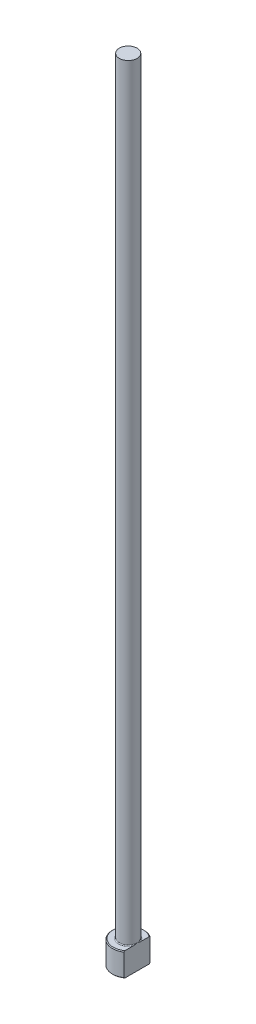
ISO-10303-21;
HEADER;
FILE_DESCRIPTION(('STEP AP214'),'2;1');
FILE_NAME('part.step','',(''),(''),'','','');
FILE_SCHEMA(('AUTOMOTIVE_DESIGN { 1 0 10303 214 1 1 1 1 }'));
ENDSEC;
DATA;
#1=APPLICATION_CONTEXT('core data for automotive mechanical design processes');
#2=APPLICATION_PROTOCOL_DEFINITION('international standard','automotive_design',2000,#1);
#3=PRODUCT_CONTEXT('',#1,'mechanical');
#4=PRODUCT('Part','Part','',(#3));
#5=PRODUCT_RELATED_PRODUCT_CATEGORY('part','',(#4));
#6=PRODUCT_DEFINITION_FORMATION('','',#4);
#7=PRODUCT_DEFINITION_CONTEXT('part definition',#1,'design');
#8=PRODUCT_DEFINITION('design','',#6,#7);
#9=PRODUCT_DEFINITION_SHAPE('','',#8);
#10=(LENGTH_UNIT() NAMED_UNIT(*) SI_UNIT(.MILLI.,.METRE.));
#11=(NAMED_UNIT(*) PLANE_ANGLE_UNIT() SI_UNIT($,.RADIAN.));
#12=(NAMED_UNIT(*) SI_UNIT($,.STERADIAN.) SOLID_ANGLE_UNIT());
#13=UNCERTAINTY_MEASURE_WITH_UNIT(LENGTH_MEASURE(1.E-05),#10,'distance_accuracy_value','');
#14=(GEOMETRIC_REPRESENTATION_CONTEXT(3) GLOBAL_UNCERTAINTY_ASSIGNED_CONTEXT((#13)) GLOBAL_UNIT_ASSIGNED_CONTEXT((#10,
#11,#12)) REPRESENTATION_CONTEXT('',''));
#15=CARTESIAN_POINT('',(0.,0.,0.));
#16=DIRECTION('',(0.,0.,1.));
#17=DIRECTION('',(1.,0.,0.));
#18=AXIS2_PLACEMENT_3D('',#15,#16,#17);
#19=CARTESIAN_POINT('',(0.,0.,0.));
#20=DIRECTION('',(0.,-1.,0.));
#21=DIRECTION('',(0.,0.,-1.));
#22=AXIS2_PLACEMENT_3D('',#19,#20,#21);
#23=PLANE('',#22);
#24=CARTESIAN_POINT('',(0.,0.,0.));
#25=DIRECTION('',(0.,-1.,0.));
#26=DIRECTION('',(0.,0.,-1.));
#27=AXIS2_PLACEMENT_3D('',#24,#25,#26);
#28=CIRCLE('',#27,3.79999999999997);
#29=CARTESIAN_POINT('',(2.24999999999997,0.,3.0622703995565));
#30=VERTEX_POINT('',#29);
#31=CARTESIAN_POINT('',(2.24999999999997,0.,-3.0622703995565));
#32=VERTEX_POINT('',#31);
#33=EDGE_CURVE('E98',#30,#32,#28,.T.);
#34=ORIENTED_EDGE('',*,*,#33,.T.);
#35=DIRECTION('',(0.,0.,1.));
#36=VECTOR('',#35,1.);
#37=CARTESIAN_POINT('',(2.24999999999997,0.,3.30718913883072));
#38=LINE('',#37,#36);
#39=EDGE_CURVE('E83',#32,#30,#38,.T.);
#40=ORIENTED_EDGE('',*,*,#39,.T.);
#41=EDGE_LOOP('',(#34,#40));
#42=FACE_BOUND('',#41,.T.);
#43=ADVANCED_FACE('F32',(#42),#23,.T.);
#44=CARTESIAN_POINT('',(0.,259.958771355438,0.));
#45=DIRECTION('',(0.,1.,0.));
#46=DIRECTION('',(0.,0.,1.));
#47=AXIS2_PLACEMENT_3D('',#44,#45,#46);
#48=CYLINDRICAL_SURFACE('',#47,3.99999999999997);
#49=CARTESIAN_POINT('',(0.,5.80000000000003,0.));
#50=DIRECTION('',(0.,1.,0.));
#51=DIRECTION('',(0.,0.,1.));
#52=AXIS2_PLACEMENT_3D('',#49,#50,#51);
#53=CIRCLE('',#52,3.99999999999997);
#54=CARTESIAN_POINT('',(2.24999999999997,5.80000000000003,3.30718913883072));
#55=VERTEX_POINT('',#54);
#56=CARTESIAN_POINT('',(2.24999999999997,5.80000000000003,-3.30718913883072));
#57=VERTEX_POINT('',#56);
#58=EDGE_CURVE('E104',#55,#57,#53,.F.);
#59=ORIENTED_EDGE('',*,*,#58,.T.);
#60=DIRECTION('',(0.,-1.,0.));
#61=VECTOR('',#60,1.);
#62=CARTESIAN_POINT('',(2.24999999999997,200.,-3.30718913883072));
#63=LINE('',#62,#61);
#64=CARTESIAN_POINT('',(2.24999999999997,0.199999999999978,-3.30718913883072));
#65=VERTEX_POINT('',#64);
#66=EDGE_CURVE('E183',#57,#65,#63,.T.);
#67=ORIENTED_EDGE('',*,*,#66,.T.);
#68=CARTESIAN_POINT('',(0.,0.199999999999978,0.));
#69=DIRECTION('',(0.,-1.,0.));
#70=DIRECTION('',(0.,0.,-1.));
#71=AXIS2_PLACEMENT_3D('',#68,#69,#70);
#72=CIRCLE('',#71,3.99999999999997);
#73=CARTESIAN_POINT('',(2.24999999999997,0.199999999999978,3.30718913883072));
#74=VERTEX_POINT('',#73);
#75=EDGE_CURVE('E100',#65,#74,#72,.F.);
#76=ORIENTED_EDGE('',*,*,#75,.T.);
#77=DIRECTION('',(0.,-1.,0.));
#78=VECTOR('',#77,1.);
#79=CARTESIAN_POINT('',(2.24999999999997,200.,3.30718913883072));
#80=LINE('',#79,#78);
#81=EDGE_CURVE('E93',#55,#74,#80,.T.);
#82=ORIENTED_EDGE('',*,*,#81,.F.);
#83=EDGE_LOOP('',(#59,#67,#76,#82));
#84=FACE_BOUND('',#83,.T.);
#85=ADVANCED_FACE('F158',(#84),#48,.T.);
#86=CARTESIAN_POINT('',(-3.99999999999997,6.,0.));
#87=DIRECTION('',(0.,1.,0.));
#88=DIRECTION('',(0.,0.,1.));
#89=AXIS2_PLACEMENT_3D('',#86,#87,#88);
#90=PLANE('',#89);
#91=CARTESIAN_POINT('',(0.,6.,0.));
#92=DIRECTION('',(0.,1.,0.));
#93=DIRECTION('',(0.,0.,1.));
#94=AXIS2_PLACEMENT_3D('',#91,#92,#93);
#95=CIRCLE('',#94,3.80000000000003);
#96=CARTESIAN_POINT('',(2.24999999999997,6.,-3.06227039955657));
#97=VERTEX_POINT('',#96);
#98=CARTESIAN_POINT('',(2.24999999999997,6.,3.06227039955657));
#99=VERTEX_POINT('',#98);
#100=EDGE_CURVE('E178',#97,#99,#95,.T.);
#101=ORIENTED_EDGE('',*,*,#100,.T.);
#102=DIRECTION('',(0.,0.,-1.));
#103=VECTOR('',#102,1.);
#104=CARTESIAN_POINT('',(2.24999999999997,6.,0.));
#105=LINE('',#104,#103);
#106=CARTESIAN_POINT('',(2.24999999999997,5.99999999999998,0.969535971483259));
#107=VERTEX_POINT('',#106);
#108=EDGE_CURVE('E57',#99,#107,#105,.T.);
#109=ORIENTED_EDGE('',*,*,#108,.T.);
#110=CARTESIAN_POINT('',(0.,6.,0.));
#111=DIRECTION('',(0.,1.,0.));
#112=DIRECTION('',(0.,0.,1.));
#113=AXIS2_PLACEMENT_3D('',#110,#111,#112);
#114=CIRCLE('',#113,2.44999999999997);
#115=CARTESIAN_POINT('',(2.24999999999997,5.99999999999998,-0.969535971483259));
#116=VERTEX_POINT('',#115);
#117=EDGE_CURVE('E107',#107,#116,#114,.F.);
#118=ORIENTED_EDGE('',*,*,#117,.T.);
#119=EDGE_CURVE('E136',#116,#97,#105,.T.);
#120=ORIENTED_EDGE('',*,*,#119,.T.);
#121=EDGE_LOOP('',(#101,#109,#118,#120));
#122=FACE_BOUND('',#121,.T.);
#123=ADVANCED_FACE('F147',(#122),#90,.T.);
#124=CARTESIAN_POINT('',(0.,6.00000000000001,0.));
#125=DIRECTION('',(0.,-1.,0.));
#126=DIRECTION('',(0.,0.,-1.));
#127=AXIS2_PLACEMENT_3D('',#124,#125,#126);
#128=CONICAL_SURFACE('',#127,3.80000000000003,0.785398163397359);
#129=ORIENTED_EDGE('',*,*,#58,.F.);
#130=CARTESIAN_POINT('',(2.24999999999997,2.1823029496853,7.27782992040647));
#131=CARTESIAN_POINT('',(2.24999999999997,2.30866715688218,7.14556140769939));
#132=CARTESIAN_POINT('',(2.24999999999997,2.4348777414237,7.01314597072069));
#133=CARTESIAN_POINT('',(2.24999999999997,2.68692885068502,6.74796170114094));
#134=CARTESIAN_POINT('',(2.24999999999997,2.81276937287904,6.61519286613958));
#135=CARTESIAN_POINT('',(2.24999999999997,3.18970572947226,6.21619905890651));
#136=CARTESIAN_POINT('',(2.24999999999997,3.44014920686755,5.94935693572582));
#137=CARTESIAN_POINT('',(2.24999999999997,3.94026066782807,5.41146981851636));
#138=CARTESIAN_POINT('',(2.24999999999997,4.18991116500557,5.14040850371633));
#139=CARTESIAN_POINT('',(2.24999999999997,4.56140055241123,4.73113683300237));
#140=CARTESIAN_POINT('',(2.24999999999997,4.68472451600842,4.59427552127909));
#141=CARTESIAN_POINT('',(2.24999999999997,4.93009407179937,4.31941326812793));
#142=CARTESIAN_POINT('',(2.24999999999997,5.05213967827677,4.18141233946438));
#143=CARTESIAN_POINT('',(2.24999999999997,5.31419582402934,3.88150807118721));
#144=CARTESIAN_POINT('',(2.24999999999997,5.4539170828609,3.71935099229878));
#145=CARTESIAN_POINT('',(2.24999999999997,5.73025215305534,3.39234412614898));
#146=CARTESIAN_POINT('',(2.24999999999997,5.86686529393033,3.22749377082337));
#147=CARTESIAN_POINT('',(2.24999999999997,6.13534139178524,2.89430849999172));
#148=CARTESIAN_POINT('',(2.24999999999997,6.26721073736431,2.72597879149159));
#149=CARTESIAN_POINT('',(2.24999999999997,6.45966785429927,2.46950762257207));
#150=CARTESIAN_POINT('',(2.24999999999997,6.52291962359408,2.38336821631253));
#151=CARTESIAN_POINT('',(2.24999999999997,6.64714184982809,2.20946418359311));
#152=CARTESIAN_POINT('',(2.24999999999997,6.7081125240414,2.12169971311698));
#153=CARTESIAN_POINT('',(2.24999999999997,6.82102230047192,1.95327886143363));
#154=CARTESIAN_POINT('',(2.24999999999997,6.87324695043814,1.87281476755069));
#155=CARTESIAN_POINT('',(2.24999999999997,6.97467249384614,1.70998172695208));
#156=CARTESIAN_POINT('',(2.24999999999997,7.02387305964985,1.62761257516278));
#157=CARTESIAN_POINT('',(2.24999999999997,7.11837607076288,1.46059799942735));
#158=CARTESIAN_POINT('',(2.24999999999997,7.16367708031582,1.37595175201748));
#159=CARTESIAN_POINT('',(2.24999999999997,7.24914050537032,1.20413766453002));
#160=CARTESIAN_POINT('',(2.24999999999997,7.28930406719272,1.11697039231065));
#161=CARTESIAN_POINT('',(2.24999999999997,7.38314726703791,0.891175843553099));
#162=CARTESIAN_POINT('',(2.24999999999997,7.43219749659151,0.750488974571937));
#163=CARTESIAN_POINT('',(2.24999999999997,7.48826674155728,0.53515963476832));
#164=CARTESIAN_POINT('',(2.24999999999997,7.5040284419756,0.462776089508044));
#165=CARTESIAN_POINT('',(2.24999999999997,7.52893388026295,0.316860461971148));
#166=CARTESIAN_POINT('',(2.24999999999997,7.53807847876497,0.24332853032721));
#167=CARTESIAN_POINT('',(2.24999999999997,7.54922474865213,0.0949504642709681));
#168=CARTESIAN_POINT('',(2.24999999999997,7.55115152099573,0.0200986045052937));
#169=CARTESIAN_POINT('',(2.24999999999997,7.54752076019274,-0.129420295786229));
#170=CARTESIAN_POINT('',(2.24999999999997,7.54196316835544,-0.204087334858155));
#171=CARTESIAN_POINT('',(2.24999999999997,7.52372329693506,-0.352688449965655));
#172=CARTESIAN_POINT('',(2.24999999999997,7.51102617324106,-0.426620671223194));
#173=CARTESIAN_POINT('',(2.24999999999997,7.47926333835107,-0.573094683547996));
#174=CARTESIAN_POINT('',(2.24999999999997,7.46019612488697,-0.645636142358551));
#175=CARTESIAN_POINT('',(2.24999999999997,7.40610994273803,-0.82370101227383));
#176=CARTESIAN_POINT('',(2.24999999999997,7.36783449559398,-0.928230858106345));
#177=CARTESIAN_POINT('',(2.24999999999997,7.28232692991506,-1.13354070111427));
#178=CARTESIAN_POINT('',(2.24999999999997,7.23508812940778,-1.23431783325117));
#179=CARTESIAN_POINT('',(2.24999999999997,7.13380125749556,-1.43298762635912));
#180=CARTESIAN_POINT('',(2.24999999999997,7.07972026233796,-1.53086330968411));
#181=CARTESIAN_POINT('',(2.24999999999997,6.99496203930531,-1.67548648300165));
#182=CARTESIAN_POINT('',(2.24999999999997,6.96610811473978,-1.72332162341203));
#183=CARTESIAN_POINT('',(2.24999999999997,6.90734436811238,-1.81833709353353));
#184=CARTESIAN_POINT('',(2.24999999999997,6.8774345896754,-1.8655174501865));
#185=CARTESIAN_POINT('',(2.24999999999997,6.77509597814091,-2.02354622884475));
#186=CARTESIAN_POINT('',(2.24999999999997,6.70057106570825,-2.13303820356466));
#187=CARTESIAN_POINT('',(2.24999999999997,6.54784662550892,-2.34943854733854));
#188=CARTESIAN_POINT('',(2.24999999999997,6.4696462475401,-2.45634630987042));
#189=CARTESIAN_POINT('',(2.24999999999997,6.31046802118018,-2.66818697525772));
#190=CARTESIAN_POINT('',(2.24999999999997,6.22948822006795,-2.77311840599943));
#191=CARTESIAN_POINT('',(2.24999999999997,6.06545223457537,-2.98134898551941));
#192=CARTESIAN_POINT('',(2.24999999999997,5.98239592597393,-3.08464803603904));
#193=CARTESIAN_POINT('',(2.24999999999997,5.73044258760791,-3.39308007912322));
#194=CARTESIAN_POINT('',(2.24999999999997,5.55914389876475,-3.59624854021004));
#195=CARTESIAN_POINT('',(2.24999999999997,5.21260420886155,-3.99901521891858));
#196=CARTESIAN_POINT('',(2.24999999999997,5.03736490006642,-4.19861490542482));
#197=CARTESIAN_POINT('',(2.24999999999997,4.68403823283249,-4.59551245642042));
#198=CARTESIAN_POINT('',(2.24999999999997,4.50594904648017,-4.79280869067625));
#199=CARTESIAN_POINT('',(2.24999999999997,4.14782580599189,-5.18566037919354));
#200=CARTESIAN_POINT('',(2.24999999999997,3.96779155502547,-5.38121565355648));
#201=CARTESIAN_POINT('',(2.24999999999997,3.60651922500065,-5.77078870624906));
#202=CARTESIAN_POINT('',(2.24999999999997,3.42528278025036,-5.96480800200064));
#203=CARTESIAN_POINT('',(2.24999999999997,3.06174631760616,-6.35184762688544));
#204=CARTESIAN_POINT('',(2.24999999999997,2.87944629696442,-6.54486795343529));
#205=CARTESIAN_POINT('',(2.24999999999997,2.6111232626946,-6.82775668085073));
#206=CARTESIAN_POINT('',(2.24999999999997,2.52542128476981,-6.91792994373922));
#207=CARTESIAN_POINT('',(2.24999999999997,2.35393773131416,-7.09803491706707));
#208=CARTESIAN_POINT('',(2.24999999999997,2.26815631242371,-7.1879667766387));
#209=CARTESIAN_POINT('',(2.24999999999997,2.1823029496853,-7.27782992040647));
#210=B_SPLINE_CURVE_WITH_KNOTS('',3,(#130,#131,#132,#133,#134,#135,#136,#137,#138,#139,#140,
#141,#142,#143,#144,#145,#146,#147,#148,#149,#150,#151,#152,#153,#154,#155,#156,#157,#158,#159,
#160,#161,#162,#163,#164,#165,#166,#167,#168,#169,#170,#171,#172,#173,#174,#175,#176,#177,#178,
#179,#180,#181,#182,#183,#184,#185,#186,#187,#188,#189,#190,#191,#192,#193,#194,#195,#196,#197,
#198,#199,#200,#201,#202,#203,#204,#205,#206,#207,#208,#209),.UNSPECIFIED.,.F.,.F.,(4,2,2,2,2,2,
2,2,2,2,2,2,2,2,2,2,2,2,2,2,2,2,2,2,2,2,2,2,2,2,2,2,2,2,2,2,2,2,2,4),(0.,0.548785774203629,
1.09757528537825,2.19544562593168,3.30094607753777,3.85362276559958,4.40629327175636,
5.04841012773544,5.69066421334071,6.33201824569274,6.65259523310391,6.97314160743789,
7.26086761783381,7.54862474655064,7.83648737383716,8.12428565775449,8.56956070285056,
8.7915473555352,9.01350513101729,9.23775987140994,9.46201637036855,9.68674086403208,
9.91151839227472,10.2448678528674,10.5784668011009,10.9137368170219,11.0813178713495,
11.2488920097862,11.6461164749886,12.0434332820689,12.4410351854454,12.838660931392,
13.63579912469,14.4326012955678,15.2299368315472,16.0273538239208,16.8238479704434,
17.6203441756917,17.9935523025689,18.3664002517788),.UNSPECIFIED.);
#211=EDGE_CURVE('E135',#55,#99,#210,.T.);
#212=ORIENTED_EDGE('',*,*,#211,.T.);
#213=ORIENTED_EDGE('',*,*,#100,.F.);
#214=EDGE_CURVE('E127',#97,#57,#210,.T.);
#215=ORIENTED_EDGE('',*,*,#214,.T.);
#216=EDGE_LOOP('',(#129,#212,#213,#215));
#217=FACE_BOUND('',#216,.T.);
#218=ADVANCED_FACE('F143',(#217),#128,.T.);
#219=CARTESIAN_POINT('',(0.,0.199999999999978,0.));
#220=DIRECTION('',(0.,1.,0.));
#221=DIRECTION('',(0.,0.,1.));
#222=AXIS2_PLACEMENT_3D('',#219,#220,#221);
#223=CONICAL_SURFACE('',#222,3.99999999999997,0.785398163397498);
#224=ORIENTED_EDGE('',*,*,#75,.F.);
#225=CARTESIAN_POINT('',(2.24999999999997,3.81769705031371,-7.27782992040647));
#226=CARTESIAN_POINT('',(2.24999999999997,3.69133284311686,-7.14556140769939));
#227=CARTESIAN_POINT('',(2.24999999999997,3.56512225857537,-7.01314597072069));
#228=CARTESIAN_POINT('',(2.24999999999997,3.31307114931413,-6.74796170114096));
#229=CARTESIAN_POINT('',(2.24999999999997,3.18723062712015,-6.6151928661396));
#230=CARTESIAN_POINT('',(2.24999999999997,2.81029427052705,-6.21619905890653));
#231=CARTESIAN_POINT('',(2.24999999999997,2.55985079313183,-5.94935693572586));
#232=CARTESIAN_POINT('',(2.24999999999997,2.05973933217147,-5.4114698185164));
#233=CARTESIAN_POINT('',(2.24999999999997,1.81008883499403,-5.14040850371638));
#234=CARTESIAN_POINT('',(2.24999999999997,1.43859944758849,-4.73113683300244));
#235=CARTESIAN_POINT('',(2.24999999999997,1.31527548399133,-4.59427552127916));
#236=CARTESIAN_POINT('',(2.24999999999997,1.06990592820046,-4.319413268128));
#237=CARTESIAN_POINT('',(2.24999999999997,0.947860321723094,-4.18141233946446));
#238=CARTESIAN_POINT('',(2.24999999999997,0.685804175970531,-3.88150807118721));
#239=CARTESIAN_POINT('',(2.24999999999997,0.546082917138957,-3.71935099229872));
#240=CARTESIAN_POINT('',(2.24999999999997,0.269747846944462,-3.39234412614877));
#241=CARTESIAN_POINT('',(2.24999999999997,0.133134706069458,-3.22749377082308));
#242=CARTESIAN_POINT('',(2.24999999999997,-0.135341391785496,-2.89430849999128));
#243=CARTESIAN_POINT('',(2.24999999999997,-0.267210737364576,-2.72597879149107));
#244=CARTESIAN_POINT('',(2.24999999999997,-0.459667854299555,-2.46950762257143));
#245=CARTESIAN_POINT('',(2.24999999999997,-0.522919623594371,-2.38336821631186));
#246=CARTESIAN_POINT('',(2.24999999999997,-0.64714184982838,-2.20946418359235));
#247=CARTESIAN_POINT('',(2.24999999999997,-0.708112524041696,-2.12169971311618));
#248=CARTESIAN_POINT('',(2.24999999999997,-0.821022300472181,-1.9532788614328));
#249=CARTESIAN_POINT('',(2.24999999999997,-0.87324695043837,-1.87281476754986));
#250=CARTESIAN_POINT('',(2.24999999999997,-0.974672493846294,-1.70998172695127));
#251=CARTESIAN_POINT('',(2.24999999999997,-1.02387305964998,-1.62761257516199));
#252=CARTESIAN_POINT('',(2.24999999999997,-1.11837607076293,-1.46059799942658));
#253=CARTESIAN_POINT('',(2.24999999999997,-1.16367708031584,-1.37595175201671));
#254=CARTESIAN_POINT('',(2.24999999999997,-1.24914050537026,-1.20413766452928));
#255=CARTESIAN_POINT('',(2.24999999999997,-1.28930406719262,-1.11697039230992));
#256=CARTESIAN_POINT('',(2.24999999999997,-1.38314726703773,-0.891175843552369));
#257=CARTESIAN_POINT('',(2.24999999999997,-1.43219749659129,-0.750488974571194));
#258=CARTESIAN_POINT('',(2.24999999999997,-1.48826674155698,-0.535159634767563));
#259=CARTESIAN_POINT('',(2.24999999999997,-1.50402844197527,-0.462776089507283));
#260=CARTESIAN_POINT('',(2.24999999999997,-1.52893388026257,-0.316860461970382));
#261=CARTESIAN_POINT('',(2.24999999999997,-1.53807847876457,-0.243328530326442));
#262=CARTESIAN_POINT('',(2.24999999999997,-1.54922474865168,-0.0949504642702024));
#263=CARTESIAN_POINT('',(2.24999999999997,-1.55115152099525,-0.0200986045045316));
#264=CARTESIAN_POINT('',(2.24999999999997,-1.54752076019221,0.129420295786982));
#265=CARTESIAN_POINT('',(2.24999999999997,-1.54196316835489,0.204087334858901));
#266=CARTESIAN_POINT('',(2.24999999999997,-1.52372329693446,0.352688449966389));
#267=CARTESIAN_POINT('',(2.24999999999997,-1.51102617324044,0.42662067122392));
#268=CARTESIAN_POINT('',(2.24999999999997,-1.47926333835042,0.573094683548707));
#269=CARTESIAN_POINT('',(2.24999999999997,-1.46019612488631,0.645636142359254));
#270=CARTESIAN_POINT('',(2.24999999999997,-1.40610994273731,0.823701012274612));
#271=CARTESIAN_POINT('',(2.24999999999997,-1.36783449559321,0.92823085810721));
#272=CARTESIAN_POINT('',(2.24999999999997,-1.28232692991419,1.1335407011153));
#273=CARTESIAN_POINT('',(2.24999999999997,-1.23508812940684,1.23431783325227));
#274=CARTESIAN_POINT('',(2.24999999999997,-1.13380125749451,1.43298762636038));
#275=CARTESIAN_POINT('',(2.24999999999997,-1.07972026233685,1.53086330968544));
#276=CARTESIAN_POINT('',(2.24999999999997,-0.994962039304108,1.6754864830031));
#277=CARTESIAN_POINT('',(2.24999999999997,-0.966108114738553,1.72332162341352));
#278=CARTESIAN_POINT('',(2.24999999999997,-0.907344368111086,1.81833709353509));
#279=CARTESIAN_POINT('',(2.24999999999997,-0.877434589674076,1.8655174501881));
#280=CARTESIAN_POINT('',(2.24999999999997,-0.775095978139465,2.0235462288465));
#281=CARTESIAN_POINT('',(2.24999999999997,-0.700571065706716,2.13303820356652));
#282=CARTESIAN_POINT('',(2.24999999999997,-0.547846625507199,2.34943854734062));
#283=CARTESIAN_POINT('',(2.24999999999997,-0.469646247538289,2.45634630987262));
#284=CARTESIAN_POINT('',(2.24999999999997,-0.310468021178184,2.66818697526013));
#285=CARTESIAN_POINT('',(2.24999999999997,-0.229488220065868,2.77311840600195));
#286=CARTESIAN_POINT('',(2.24999999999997,-0.065452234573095,2.98134898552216));
#287=CARTESIAN_POINT('',(2.24999999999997,0.0176040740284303,3.0846480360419));
#288=CARTESIAN_POINT('',(2.24999999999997,0.269557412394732,3.39308007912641));
#289=CARTESIAN_POINT('',(2.24999999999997,0.440856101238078,3.59624854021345));
#290=CARTESIAN_POINT('',(2.24999999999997,0.787395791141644,3.99901521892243));
#291=CARTESIAN_POINT('',(2.24999999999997,0.962635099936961,4.19861490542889));
#292=CARTESIAN_POINT('',(2.24999999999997,1.31596176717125,4.59551245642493));
#293=CARTESIAN_POINT('',(2.24999999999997,1.49405095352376,4.79280869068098));
#294=CARTESIAN_POINT('',(2.24999999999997,1.8521741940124,5.18566037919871));
#295=CARTESIAN_POINT('',(2.24999999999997,2.03220844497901,5.38121565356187));
#296=CARTESIAN_POINT('',(2.24999999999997,2.39348077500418,5.7707887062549));
#297=CARTESIAN_POINT('',(2.24999999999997,2.57471721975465,5.9648080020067));
#298=CARTESIAN_POINT('',(2.24999999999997,2.93825368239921,6.35184762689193));
#299=CARTESIAN_POINT('',(2.24999999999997,3.12055370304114,6.54486795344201));
#300=CARTESIAN_POINT('',(2.24999999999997,3.38887673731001,6.82775668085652));
#301=CARTESIAN_POINT('',(2.24999999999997,3.47457871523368,6.91792994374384));
#302=CARTESIAN_POINT('',(2.24999999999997,3.64606226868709,7.09803491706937));
#303=CARTESIAN_POINT('',(2.24999999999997,3.73184368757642,7.18796677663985));
#304=CARTESIAN_POINT('',(2.24999999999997,3.81769705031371,7.27782992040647));
#305=B_SPLINE_CURVE_WITH_KNOTS('',3,(#225,#226,#227,#228,#229,#230,#231,#232,#233,#234,#235,
#236,#237,#238,#239,#240,#241,#242,#243,#244,#245,#246,#247,#248,#249,#250,#251,#252,#253,#254,
#255,#256,#257,#258,#259,#260,#261,#262,#263,#264,#265,#266,#267,#268,#269,#270,#271,#272,#273,
#274,#275,#276,#277,#278,#279,#280,#281,#282,#283,#284,#285,#286,#287,#288,#289,#290,#291,#292,
#293,#294,#295,#296,#297,#298,#299,#300,#301,#302,#303,#304),.UNSPECIFIED.,.F.,.F.,(4,2,2,2,2,2,
2,2,2,2,2,2,2,2,2,2,2,2,2,2,2,2,2,2,2,2,2,2,2,2,2,2,2,2,2,2,2,2,2,4),(0.,0.548785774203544,
1.09757528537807,2.19544562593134,3.30094607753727,3.853622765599,4.40629327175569,
5.04841012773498,5.69066421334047,6.33201824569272,6.65259523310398,6.97314160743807,
7.26086761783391,7.54862474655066,7.8364873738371,8.12428565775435,8.56956070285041,
8.79154735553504,9.01350513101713,9.23775987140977,9.46201637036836,9.68674086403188,
9.91151839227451,10.2448678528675,10.5784668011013,10.9137368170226,11.0813178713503,
11.2488920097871,11.6461164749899,12.0434332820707,12.4410351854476,12.8386609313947,
13.6357991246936,14.4326012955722,15.2299368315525,16.0273538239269,16.8238479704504,
17.6203441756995,17.9935523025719,18.3664002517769),.UNSPECIFIED.);
#306=EDGE_CURVE('E86',#65,#32,#305,.T.);
#307=ORIENTED_EDGE('',*,*,#306,.T.);
#308=ORIENTED_EDGE('',*,*,#33,.F.);
#309=EDGE_CURVE('E89',#30,#74,#305,.T.);
#310=ORIENTED_EDGE('',*,*,#309,.T.);
#311=EDGE_LOOP('',(#224,#307,#308,#310));
#312=FACE_BOUND('',#311,.T.);
#313=ADVANCED_FACE('F97',(#312),#223,.T.);
#314=CARTESIAN_POINT('',(0.,6.19999999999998,0.));
#315=DIRECTION('',(0.,1.,0.));
#316=DIRECTION('',(0.,0.,1.));
#317=AXIS2_PLACEMENT_3D('',#314,#315,#316);
#318=TOROIDAL_SURFACE('',#317,2.44999999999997,0.2);
#319=CARTESIAN_POINT('',(2.24999999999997,6.19999999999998,0.));
#320=CARTESIAN_POINT('',(2.24999999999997,6.20000050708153,6.4472369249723E-11));
#321=CARTESIAN_POINT('',(2.24999999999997,6.200001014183,-1.58891192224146E-07));
#322=CARTESIAN_POINT('',(2.24999999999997,6.20000197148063,-6.21779248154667E-07));
#323=CARTESIAN_POINT('',(2.24999999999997,6.20000241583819,-9.34460769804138E-07));
#324=CARTESIAN_POINT('',(2.24999999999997,6.20000332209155,-1.68105192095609E-06));
#325=CARTESIAN_POINT('',(2.24999999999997,6.20000377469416,-2.1264637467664E-06));
#326=CARTESIAN_POINT('',(2.24999999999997,6.2000046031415,-3.06333878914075E-06));
#327=CARTESIAN_POINT('',(2.24999999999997,6.20000498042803,-3.55360519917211E-06));
#328=CARTESIAN_POINT('',(2.24999999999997,6.20000633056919,-5.39956012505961E-06));
#329=CARTESIAN_POINT('',(2.24999999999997,6.20000722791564,-6.81237625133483E-06));
#330=CARTESIAN_POINT('',(2.24999999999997,6.20000875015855,-9.65315888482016E-06));
#331=CARTESIAN_POINT('',(2.24999999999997,6.2000093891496,-1.10739427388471E-05));
#332=CARTESIAN_POINT('',(2.24999999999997,6.20001197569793,-1.69289387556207E-05));
#333=CARTESIAN_POINT('',(2.24999999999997,6.20001384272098,-2.14029808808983E-05));
#334=CARTESIAN_POINT('',(2.24999999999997,6.20001668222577,-2.99701700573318E-05));
#335=CARTESIAN_POINT('',(2.24999999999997,6.20001774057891,-3.40349907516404E-05));
#336=CARTESIAN_POINT('',(2.24999999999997,6.2000252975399,-6.37611260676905E-05));
#337=CARTESIAN_POINT('',(2.24999999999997,6.20003087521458,-8.96095287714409E-05));
#338=CARTESIAN_POINT('',(2.24999999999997,6.20005527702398,-0.000191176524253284));
#339=CARTESIAN_POINT('',(2.24999999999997,6.20007870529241,-0.000265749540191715));
#340=CARTESIAN_POINT('',(2.24999999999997,6.20016937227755,-0.000559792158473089));
#341=CARTESIAN_POINT('',(2.24999999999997,6.20023350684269,-0.000779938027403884));
#342=CARTESIAN_POINT('',(2.24999999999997,6.20048920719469,-0.0016505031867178));
#343=CARTESIAN_POINT('',(2.24999999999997,6.20068459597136,-0.00230007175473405));
#344=CARTESIAN_POINT('',(2.24999999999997,6.20149322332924,-0.00499620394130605));
#345=CARTESIAN_POINT('',(2.24999999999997,6.20210170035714,-0.00704382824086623));
#346=CARTESIAN_POINT('',(2.24999999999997,6.20797104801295,-0.0267853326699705));
#347=CARTESIAN_POINT('',(2.24999999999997,6.21325284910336,-0.0444747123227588));
#348=CARTESIAN_POINT('',(2.24999999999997,6.22356918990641,-0.079173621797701));
#349=CARTESIAN_POINT('',(2.24999999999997,6.22860532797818,-0.0961827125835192));
#350=CARTESIAN_POINT('',(2.24999999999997,6.23925368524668,-0.132326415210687));
#351=CARTESIAN_POINT('',(2.24999999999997,6.24485983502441,-0.151462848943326));
#352=CARTESIAN_POINT('',(2.24999999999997,6.25603662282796,-0.18996857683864));
#353=CARTESIAN_POINT('',(2.24999999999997,6.26160623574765,-0.209338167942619));
#354=CARTESIAN_POINT('',(2.24999999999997,6.2750031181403,-0.256523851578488));
#355=CARTESIAN_POINT('',(2.24999999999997,6.28276182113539,-0.284359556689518));
#356=CARTESIAN_POINT('',(2.24999999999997,6.29771346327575,-0.339425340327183));
#357=CARTESIAN_POINT('',(2.24999999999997,6.30491576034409,-0.366652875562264));
#358=CARTESIAN_POINT('',(2.24999999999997,6.32240345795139,-0.435090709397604));
#359=CARTESIAN_POINT('',(2.24999999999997,6.33239618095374,-0.47637702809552));
#360=CARTESIAN_POINT('',(2.24999999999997,6.35100390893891,-0.559624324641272));
#361=CARTESIAN_POINT('',(2.24999999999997,6.3596067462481,-0.601588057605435));
#362=CARTESIAN_POINT('',(2.24999999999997,6.37543235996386,-0.689258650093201));
#363=CARTESIAN_POINT('',(2.24999999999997,6.38248971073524,-0.734996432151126));
#364=CARTESIAN_POINT('',(2.24999999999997,6.39342529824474,-0.826730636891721));
#365=CARTESIAN_POINT('',(2.24999999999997,6.39731270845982,-0.87272592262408));
#366=CARTESIAN_POINT('',(2.24999999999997,6.40071499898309,-0.963783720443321));
#367=CARTESIAN_POINT('',(2.24999999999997,6.40033773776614,-1.00884048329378));
#368=CARTESIAN_POINT('',(2.24999999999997,6.39535803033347,-1.0757756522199));
#369=CARTESIAN_POINT('',(2.24999999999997,6.39299580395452,-1.0978184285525));
#370=CARTESIAN_POINT('',(2.24999999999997,6.38649339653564,-1.14163100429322));
#371=CARTESIAN_POINT('',(2.24999999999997,6.38235512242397,-1.16340107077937));
#372=CARTESIAN_POINT('',(2.24999999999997,6.37178290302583,-1.20664751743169));
#373=CARTESIAN_POINT('',(2.24999999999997,6.36532376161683,-1.22811787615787));
#374=CARTESIAN_POINT('',(2.24999999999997,6.34940253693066,-1.26994619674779));
#375=CARTESIAN_POINT('',(2.24999999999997,6.33994859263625,-1.29030700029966));
#376=CARTESIAN_POINT('',(2.24999999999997,6.32341167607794,-1.31784149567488));
#377=CARTESIAN_POINT('',(2.24999999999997,6.31797729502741,-1.32600125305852));
#378=CARTESIAN_POINT('',(2.24999999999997,6.30618383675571,-1.34165219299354));
#379=CARTESIAN_POINT('',(2.24999999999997,6.29982370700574,-1.34914259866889));
#380=CARTESIAN_POINT('',(2.24999999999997,6.28597385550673,-1.36322511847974));
#381=CARTESIAN_POINT('',(2.24999999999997,6.27846961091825,-1.36980324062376));
#382=CARTESIAN_POINT('',(2.24999999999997,6.26235014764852,-1.38141777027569));
#383=CARTESIAN_POINT('',(2.24999999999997,6.25373945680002,-1.38646019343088));
#384=CARTESIAN_POINT('',(2.24999999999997,6.23893119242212,-1.39291408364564));
#385=CARTESIAN_POINT('',(2.24999999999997,6.23301804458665,-1.39497873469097));
#386=CARTESIAN_POINT('',(2.24999999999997,6.22092968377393,-1.3980973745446));
#387=CARTESIAN_POINT('',(2.24999999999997,6.21475469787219,-1.39915222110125));
#388=CARTESIAN_POINT('',(2.24999999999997,6.20229305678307,-1.4001597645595));
#389=CARTESIAN_POINT('',(2.24999999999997,6.19600609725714,-1.40010876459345));
#390=CARTESIAN_POINT('',(2.24999999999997,6.18353929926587,-1.39890051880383));
#391=CARTESIAN_POINT('',(2.24999999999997,6.17735949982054,-1.39774287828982));
#392=CARTESIAN_POINT('',(2.24999999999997,6.16550896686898,-1.39448677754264));
#393=CARTESIAN_POINT('',(2.24999999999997,6.15982782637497,-1.39242539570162));
#394=CARTESIAN_POINT('',(2.24999999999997,6.14882191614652,-1.38751374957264));
#395=CARTESIAN_POINT('',(2.24999999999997,6.14349727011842,-1.38466321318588));
#396=CARTESIAN_POINT('',(2.24999999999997,6.13026923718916,-1.37647479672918));
#397=CARTESIAN_POINT('',(2.24999999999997,6.12266499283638,-1.37065399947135));
#398=CARTESIAN_POINT('',(2.24999999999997,6.10845647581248,-1.35789458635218));
#399=CARTESIAN_POINT('',(2.24999999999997,6.10185542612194,-1.3509525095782));
#400=CARTESIAN_POINT('',(2.24999999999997,6.0855320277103,-1.33150080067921));
#401=CARTESIAN_POINT('',(2.24999999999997,6.07660573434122,-1.31832816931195));
#402=CARTESIAN_POINT('',(2.24999999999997,6.06078136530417,-1.29086374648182));
#403=CARTESIAN_POINT('',(2.24999999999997,6.05388481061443,-1.27657112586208));
#404=CARTESIAN_POINT('',(2.24999999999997,6.03602738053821,-1.23377116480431));
#405=CARTESIAN_POINT('',(2.24999999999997,6.02722778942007,-1.20437236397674));
#406=CARTESIAN_POINT('',(2.24999999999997,6.01362163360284,-1.14441037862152));
#407=CARTESIAN_POINT('',(2.24999999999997,6.00886464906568,-1.11383741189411));
#408=CARTESIAN_POINT('',(2.24999999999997,6.00105881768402,-1.03966563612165));
#409=CARTESIAN_POINT('',(2.24999999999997,5.99953171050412,-0.995912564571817));
#410=CARTESIAN_POINT('',(2.24999999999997,6.00070174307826,-0.908367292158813));
#411=CARTESIAN_POINT('',(2.24999999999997,6.00341475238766,-0.864575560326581));
#412=CARTESIAN_POINT('',(2.24999999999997,6.01171554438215,-0.779778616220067));
#413=CARTESIAN_POINT('',(2.24999999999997,6.01713219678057,-0.738755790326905));
#414=CARTESIAN_POINT('',(2.24999999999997,6.03001638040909,-0.657360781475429));
#415=CARTESIAN_POINT('',(2.24999999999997,6.03746816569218,-0.616986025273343));
#416=CARTESIAN_POINT('',(2.24999999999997,6.05405724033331,-0.535981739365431));
#417=CARTESIAN_POINT('',(2.24999999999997,6.06321733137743,-0.49535695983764));
#418=CARTESIAN_POINT('',(2.24999999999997,6.08297396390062,-0.413374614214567));
#419=CARTESIAN_POINT('',(2.24999999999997,6.09360096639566,-0.372024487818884));
#420=CARTESIAN_POINT('',(2.24999999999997,6.11230155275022,-0.30230690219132));
#421=CARTESIAN_POINT('',(2.24999999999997,6.12014883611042,-0.273877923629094));
#422=CARTESIAN_POINT('',(2.24999999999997,6.13605900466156,-0.217411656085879));
#423=CARTESIAN_POINT('',(2.24999999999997,6.14411864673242,-0.189373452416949));
#424=CARTESIAN_POINT('',(2.24999999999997,6.15951571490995,-0.136466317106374));
#425=CARTESIAN_POINT('',(2.24999999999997,6.16683378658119,-0.111591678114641));
#426=CARTESIAN_POINT('',(2.24999999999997,6.18187191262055,-0.0608432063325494));
#427=CARTESIAN_POINT('',(2.24999999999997,6.18959608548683,-0.0349705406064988));
#428=CARTESIAN_POINT('',(2.24999999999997,6.19789887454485,-0.00704171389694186));
#429=CARTESIAN_POINT('',(2.24999999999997,6.19850801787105,-0.00499199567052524));
#430=CARTESIAN_POINT('',(2.24999999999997,6.19931680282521,-0.00229537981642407));
#431=CARTESIAN_POINT('',(2.24999999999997,6.19951170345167,-0.00164742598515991));
#432=CARTESIAN_POINT('',(2.24999999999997,6.19976680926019,-0.00077888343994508));
#433=CARTESIAN_POINT('',(2.24999999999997,6.19983082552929,-0.000559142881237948));
#434=CARTESIAN_POINT('',(2.24999999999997,6.19992134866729,-0.000265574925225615));
#435=CARTESIAN_POINT('',(2.24999999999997,6.19994475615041,-0.000191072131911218));
#436=CARTESIAN_POINT('',(2.24999999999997,6.19996913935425,-8.95867309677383E-05));
#437=CARTESIAN_POINT('',(2.24999999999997,6.19997471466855,-6.37485906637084E-05));
#438=CARTESIAN_POINT('',(2.24999999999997,6.19998226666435,-3.40328342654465E-05));
#439=CARTESIAN_POINT('',(2.24999999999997,6.19998332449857,-2.99686229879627E-05));
#440=CARTESIAN_POINT('',(2.24999999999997,6.19998616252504,-2.14026475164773E-05));
#441=CARTESIAN_POINT('',(2.24999999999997,6.1999880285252,-1.69291779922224E-05));
#442=CARTESIAN_POINT('',(2.24999999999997,6.19999061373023,-1.10747627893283E-05));
#443=CARTESIAN_POINT('',(2.24999999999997,6.19999125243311,-9.65402450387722E-06));
#444=CARTESIAN_POINT('',(2.24999999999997,6.19999277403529,-6.81328220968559E-06));
#445=CARTESIAN_POINT('',(2.24999999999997,6.19999367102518,-5.40045588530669E-06));
#446=CARTESIAN_POINT('',(2.24999999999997,6.19999502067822,-3.55442704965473E-06));
#447=CARTESIAN_POINT('',(2.24999999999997,6.19999539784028,-3.06412586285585E-06));
#448=CARTESIAN_POINT('',(2.24999999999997,6.19999622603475,-2.1271588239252E-06));
#449=CARTESIAN_POINT('',(2.24999999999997,6.19999667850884,-1.68168919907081E-06));
#450=CARTESIAN_POINT('',(2.24999999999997,6.19999758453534,-9.34960589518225E-07));
#451=CARTESIAN_POINT('',(2.24999999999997,6.19999802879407,-6.22203847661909E-07));
#452=CARTESIAN_POINT('',(2.24999999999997,6.19999898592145,-1.59128809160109E-07));
#453=CARTESIAN_POINT('',(2.24999999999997,6.19999949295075,-6.44682611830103E-11));
#454=CARTESIAN_POINT('',(2.24999999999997,6.19999999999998,0.));
#455=B_SPLINE_CURVE_WITH_KNOTS('',3,(#319,#320,#321,#322,#323,#324,#325,#326,#327,#328,#329,
#330,#331,#332,#333,#334,#335,#336,#337,#338,#339,#340,#341,#342,#343,#344,#345,#346,#347,#348,
#349,#350,#351,#352,#353,#354,#355,#356,#357,#358,#359,#360,#361,#362,#363,#364,#365,#366,#367,
#368,#369,#370,#371,#372,#373,#374,#375,#376,#377,#378,#379,#380,#381,#382,#383,#384,#385,#386,
#387,#388,#389,#390,#391,#392,#393,#394,#395,#396,#397,#398,#399,#400,#401,#402,#403,#404,#405,
#406,#407,#408,#409,#410,#411,#412,#413,#414,#415,#416,#417,#418,#419,#420,#421,#422,#423,#424,
#425,#426,#427,#428,#429,#430,#431,#432,#433,#434,#435,#436,#437,#438,#439,#440,#441,#442,#443,
#444,#445,#446,#447,#448,#449,#450,#451,#452,#453,#454),.UNSPECIFIED.,.T.,.F.,(4,2,2,2,2,2,2,2,
2,2,2,2,2,2,2,2,2,2,2,2,2,2,2,2,2,2,2,2,2,2,2,2,2,2,2,2,2,2,2,2,2,2,2,2,2,2,2,2,2,2,2,2,2,2,2,2,
2,2,2,2,2,2,2,2,2,2,2,4),(0.,1.52660884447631E-06,3.15241325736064E-06,5.04759831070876E-06,
6.90201334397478E-06,1.19024881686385E-05,1.65722255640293E-05,3.10841859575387E-05,
4.36688549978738E-05,0.000123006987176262,0.00035721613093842,0.00104540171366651,
0.00308000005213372,0.0094887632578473,0.0648698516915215,0.118087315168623,0.17790910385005,
0.23837224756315,0.325060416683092,0.409550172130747,0.536965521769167,0.665442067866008,
0.804194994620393,0.942544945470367,1.07740386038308,1.14385780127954,1.21024056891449,
1.27736693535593,1.34431241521,1.37367425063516,1.40306973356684,1.43287536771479,
1.46256269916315,1.48127715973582,1.49997570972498,1.51873677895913,1.53750454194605,
1.55556541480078,1.57363252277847,1.6021966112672,1.63085061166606,1.67831692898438,
1.72581872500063,1.81736829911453,1.91002510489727,2.04102939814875,2.17252517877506,
2.29658958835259,2.41972004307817,2.54462990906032,2.67269769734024,2.76117244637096,
2.84869182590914,2.92647873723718,3.00747864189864,3.01389398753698,3.01592352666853,
3.01661044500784,3.0168444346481,3.01692374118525,3.0169363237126,3.01695083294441,
3.01695550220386,3.01696050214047,3.01696235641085,3.01696425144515,3.01696587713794,
3.01696740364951),.UNSPECIFIED.);
#456=CARTESIAN_POINT('',(2.24999999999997,6.19999999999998,0.));
#457=VERTEX_POINT('',#456);
#458=EDGE_CURVE('E11',#116,#457,#455,.T.);
#459=ORIENTED_EDGE('',*,*,#458,.F.);
#460=ORIENTED_EDGE('',*,*,#117,.F.);
#461=CARTESIAN_POINT('',(2.24999999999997,6.19999999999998,0.));
#462=CARTESIAN_POINT('',(2.24999999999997,6.19999949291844,-6.44724846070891E-11));
#463=CARTESIAN_POINT('',(2.24999999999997,6.19999898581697,1.5889119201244E-07));
#464=CARTESIAN_POINT('',(2.24999999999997,6.19999802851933,6.21779248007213E-07));
#465=CARTESIAN_POINT('',(2.24999999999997,6.19999758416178,9.34460769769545E-07));
#466=CARTESIAN_POINT('',(2.24999999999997,6.19999667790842,1.68105192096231E-06));
#467=CARTESIAN_POINT('',(2.24999999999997,6.19999622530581,2.12646374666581E-06));
#468=CARTESIAN_POINT('',(2.24999999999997,6.19999539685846,3.06333878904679E-06));
#469=CARTESIAN_POINT('',(2.24999999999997,6.19999501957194,3.55360519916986E-06));
#470=CARTESIAN_POINT('',(2.24999999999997,6.19999366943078,5.3995601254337E-06));
#471=CARTESIAN_POINT('',(2.24999999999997,6.19999277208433,6.81237625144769E-06));
#472=CARTESIAN_POINT('',(2.24999999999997,6.19999124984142,9.65315888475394E-06));
#473=CARTESIAN_POINT('',(2.24999999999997,6.19999061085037,1.10739427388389E-05));
#474=CARTESIAN_POINT('',(2.24999999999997,6.19998802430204,1.69289387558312E-05));
#475=CARTESIAN_POINT('',(2.24999999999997,6.19998615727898,2.14029808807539E-05));
#476=CARTESIAN_POINT('',(2.24999999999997,6.19998331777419,2.99701700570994E-05));
#477=CARTESIAN_POINT('',(2.24999999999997,6.19998225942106,3.40349907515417E-05));
#478=CARTESIAN_POINT('',(2.24999999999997,6.19997470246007,6.37611260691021E-05));
#479=CARTESIAN_POINT('',(2.24999999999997,6.19996912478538,8.96095287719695E-05));
#480=CARTESIAN_POINT('',(2.24999999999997,6.19994472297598,0.000191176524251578));
#481=CARTESIAN_POINT('',(2.24999999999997,6.19992129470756,0.000265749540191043));
#482=CARTESIAN_POINT('',(2.24999999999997,6.19983062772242,0.000559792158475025));
#483=CARTESIAN_POINT('',(2.24999999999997,6.19976649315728,0.000779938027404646));
#484=CARTESIAN_POINT('',(2.24999999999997,6.19951079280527,0.00165050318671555));
#485=CARTESIAN_POINT('',(2.24999999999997,6.1993154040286,0.00230007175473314));
#486=CARTESIAN_POINT('',(2.24999999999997,6.19850677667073,0.0049962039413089));
#487=CARTESIAN_POINT('',(2.24999999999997,6.19789829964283,0.00704382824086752));
#488=CARTESIAN_POINT('',(2.24999999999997,6.19202895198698,0.0267853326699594));
#489=CARTESIAN_POINT('',(2.24999999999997,6.1867471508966,0.044474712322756));
#490=CARTESIAN_POINT('',(2.24999999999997,6.17643081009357,0.0791736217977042));
#491=CARTESIAN_POINT('',(2.24999999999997,6.17139467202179,0.0961827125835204));
#492=CARTESIAN_POINT('',(2.24999999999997,6.16074631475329,0.132326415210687));
#493=CARTESIAN_POINT('',(2.24999999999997,6.15514016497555,0.151462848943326));
#494=CARTESIAN_POINT('',(2.24999999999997,6.143963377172,0.189968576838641));
#495=CARTESIAN_POINT('',(2.24999999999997,6.13839376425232,0.209338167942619));
#496=CARTESIAN_POINT('',(2.24999999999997,6.12499688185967,0.256523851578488));
#497=CARTESIAN_POINT('',(2.24999999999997,6.11723817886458,0.284359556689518));
#498=CARTESIAN_POINT('',(2.24999999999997,6.10228653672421,0.339425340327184));
#499=CARTESIAN_POINT('',(2.24999999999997,6.09508423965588,0.366652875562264));
#500=CARTESIAN_POINT('',(2.24999999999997,6.07759654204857,0.435090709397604));
#501=CARTESIAN_POINT('',(2.24999999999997,6.06760381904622,0.476377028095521));
#502=CARTESIAN_POINT('',(2.24999999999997,6.04899609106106,0.559624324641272));
#503=CARTESIAN_POINT('',(2.24999999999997,6.04039325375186,0.601588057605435));
#504=CARTESIAN_POINT('',(2.24999999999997,6.02456764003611,0.689258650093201));
#505=CARTESIAN_POINT('',(2.24999999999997,6.01751028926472,0.734996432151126));
#506=CARTESIAN_POINT('',(2.24999999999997,6.00657470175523,0.826730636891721));
#507=CARTESIAN_POINT('',(2.24999999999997,6.00268729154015,0.87272592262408));
#508=CARTESIAN_POINT('',(2.24999999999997,5.99928500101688,0.963783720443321));
#509=CARTESIAN_POINT('',(2.24999999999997,5.99966226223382,1.00884048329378));
#510=CARTESIAN_POINT('',(2.24999999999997,6.0046419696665,1.0757756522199));
#511=CARTESIAN_POINT('',(2.24999999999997,6.00700419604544,1.0978184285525));
#512=CARTESIAN_POINT('',(2.24999999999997,6.01350660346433,1.14163100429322));
#513=CARTESIAN_POINT('',(2.24999999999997,6.01764487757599,1.16340107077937));
#514=CARTESIAN_POINT('',(2.24999999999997,6.02821709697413,1.20664751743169));
#515=CARTESIAN_POINT('',(2.24999999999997,6.03467623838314,1.22811787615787));
#516=CARTESIAN_POINT('',(2.24999999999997,6.05059746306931,1.26994619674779));
#517=CARTESIAN_POINT('',(2.24999999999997,6.06005140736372,1.29030700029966));
#518=CARTESIAN_POINT('',(2.24999999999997,6.07658832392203,1.31784149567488));
#519=CARTESIAN_POINT('',(2.24999999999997,6.08202270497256,1.32600125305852));
#520=CARTESIAN_POINT('',(2.24999999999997,6.09381616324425,1.34165219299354));
#521=CARTESIAN_POINT('',(2.24999999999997,6.10017629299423,1.34914259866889));
#522=CARTESIAN_POINT('',(2.24999999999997,6.11402614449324,1.36322511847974));
#523=CARTESIAN_POINT('',(2.24999999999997,6.12153038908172,1.36980324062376));
#524=CARTESIAN_POINT('',(2.24999999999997,6.13764985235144,1.38141777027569));
#525=CARTESIAN_POINT('',(2.24999999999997,6.14626054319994,1.38646019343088));
#526=CARTESIAN_POINT('',(2.24999999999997,6.16106880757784,1.39291408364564));
#527=CARTESIAN_POINT('',(2.24999999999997,6.16698195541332,1.39497873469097));
#528=CARTESIAN_POINT('',(2.24999999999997,6.17907031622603,1.3980973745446));
#529=CARTESIAN_POINT('',(2.24999999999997,6.18524530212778,1.39915222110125));
#530=CARTESIAN_POINT('',(2.24999999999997,6.1977069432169,1.4001597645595));
#531=CARTESIAN_POINT('',(2.24999999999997,6.20399390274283,1.40010876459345));
#532=CARTESIAN_POINT('',(2.24999999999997,6.21646070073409,1.39890051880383));
#533=CARTESIAN_POINT('',(2.24999999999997,6.22264050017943,1.39774287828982));
#534=CARTESIAN_POINT('',(2.24999999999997,6.23449103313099,1.39448677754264));
#535=CARTESIAN_POINT('',(2.24999999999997,6.24017217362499,1.39242539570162));
#536=CARTESIAN_POINT('',(2.24999999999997,6.25117808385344,1.38751374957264));
#537=CARTESIAN_POINT('',(2.24999999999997,6.25650272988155,1.38466321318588));
#538=CARTESIAN_POINT('',(2.24999999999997,6.26973076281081,1.37647479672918));
#539=CARTESIAN_POINT('',(2.24999999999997,6.27733500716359,1.37065399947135));
#540=CARTESIAN_POINT('',(2.24999999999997,6.29154352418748,1.35789458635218));
#541=CARTESIAN_POINT('',(2.24999999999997,6.29814457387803,1.3509525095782));
#542=CARTESIAN_POINT('',(2.24999999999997,6.31446797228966,1.33150080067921));
#543=CARTESIAN_POINT('',(2.24999999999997,6.32339426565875,1.31832816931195));
#544=CARTESIAN_POINT('',(2.24999999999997,6.3392186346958,1.29086374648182));
#545=CARTESIAN_POINT('',(2.24999999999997,6.34611518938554,1.27657112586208));
#546=CARTESIAN_POINT('',(2.24999999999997,6.36397261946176,1.23377116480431));
#547=CARTESIAN_POINT('',(2.24999999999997,6.3727722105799,1.20437236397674));
#548=CARTESIAN_POINT('',(2.24999999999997,6.38637836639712,1.14441037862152));
#549=CARTESIAN_POINT('',(2.24999999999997,6.39113535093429,1.11383741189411));
#550=CARTESIAN_POINT('',(2.24999999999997,6.39894118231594,1.03966563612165));
#551=CARTESIAN_POINT('',(2.24999999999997,6.40046828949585,0.995912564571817));
#552=CARTESIAN_POINT('',(2.24999999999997,6.3992982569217,0.908367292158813));
#553=CARTESIAN_POINT('',(2.24999999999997,6.39658524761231,0.864575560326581));
#554=CARTESIAN_POINT('',(2.24999999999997,6.38828445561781,0.779778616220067));
#555=CARTESIAN_POINT('',(2.24999999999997,6.38286780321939,0.738755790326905));
#556=CARTESIAN_POINT('',(2.24999999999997,6.36998361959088,0.657360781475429));
#557=CARTESIAN_POINT('',(2.24999999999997,6.36253183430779,0.616986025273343));
#558=CARTESIAN_POINT('',(2.24999999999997,6.34594275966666,0.535981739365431));
#559=CARTESIAN_POINT('',(2.24999999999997,6.33678266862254,0.49535695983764));
#560=CARTESIAN_POINT('',(2.24999999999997,6.31702603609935,0.413374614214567));
#561=CARTESIAN_POINT('',(2.24999999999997,6.3063990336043,0.372024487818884));
#562=CARTESIAN_POINT('',(2.24999999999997,6.28769844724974,0.30230690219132));
#563=CARTESIAN_POINT('',(2.24999999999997,6.27985116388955,0.273877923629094));
#564=CARTESIAN_POINT('',(2.24999999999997,6.26394099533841,0.217411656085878));
#565=CARTESIAN_POINT('',(2.24999999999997,6.25588135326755,0.189373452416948));
#566=CARTESIAN_POINT('',(2.24999999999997,6.24048428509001,0.136466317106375));
#567=CARTESIAN_POINT('',(2.24999999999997,6.23316621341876,0.111591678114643));
#568=CARTESIAN_POINT('',(2.24999999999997,6.21812808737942,0.0608432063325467));
#569=CARTESIAN_POINT('',(2.24999999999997,6.21040391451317,0.0349705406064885));
#570=CARTESIAN_POINT('',(2.24999999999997,6.20210112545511,0.00704171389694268));
#571=CARTESIAN_POINT('',(2.24999999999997,6.20149198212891,0.00499199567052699));
#572=CARTESIAN_POINT('',(2.24999999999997,6.20068319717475,0.00229537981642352));
#573=CARTESIAN_POINT('',(2.24999999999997,6.2004882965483,0.00164742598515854));
#574=CARTESIAN_POINT('',(2.24999999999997,6.20023319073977,0.000778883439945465));
#575=CARTESIAN_POINT('',(2.24999999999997,6.20016917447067,0.000559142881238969));
#576=CARTESIAN_POINT('',(2.24999999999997,6.20007865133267,0.000265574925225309));
#577=CARTESIAN_POINT('',(2.24999999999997,6.20005524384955,0.000191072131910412));
#578=CARTESIAN_POINT('',(2.24999999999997,6.20003086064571,8.95867309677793E-05));
#579=CARTESIAN_POINT('',(2.24999999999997,6.20002528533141,6.37485906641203E-05));
#580=CARTESIAN_POINT('',(2.24999999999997,6.20001773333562,3.40328342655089E-05));
#581=CARTESIAN_POINT('',(2.24999999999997,6.2000166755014,2.99686229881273E-05));
#582=CARTESIAN_POINT('',(2.24999999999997,6.20001383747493,2.14026475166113E-05));
#583=CARTESIAN_POINT('',(2.24999999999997,6.20001197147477,1.69291779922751E-05));
#584=CARTESIAN_POINT('',(2.24999999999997,6.20000938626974,1.10747627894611E-05));
#585=CARTESIAN_POINT('',(2.24999999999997,6.20000874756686,9.65402450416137E-06));
#586=CARTESIAN_POINT('',(2.24999999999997,6.20000722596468,6.81328220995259E-06));
#587=CARTESIAN_POINT('',(2.24999999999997,6.20000632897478,5.40045588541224E-06));
#588=CARTESIAN_POINT('',(2.24999999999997,6.20000497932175,3.55442704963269E-06));
#589=CARTESIAN_POINT('',(2.24999999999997,6.20000460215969,3.06412586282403E-06));
#590=CARTESIAN_POINT('',(2.24999999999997,6.20000377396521,2.12715882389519E-06));
#591=CARTESIAN_POINT('',(2.24999999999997,6.20000332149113,1.68168919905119E-06));
#592=CARTESIAN_POINT('',(2.24999999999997,6.20000241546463,9.34960589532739E-07));
#593=CARTESIAN_POINT('',(2.24999999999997,6.2000019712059,6.22203847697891E-07));
#594=CARTESIAN_POINT('',(2.24999999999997,6.20000101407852,1.59128809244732E-07));
#595=CARTESIAN_POINT('',(2.24999999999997,6.20000050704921,6.44683764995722E-11));
#596=CARTESIAN_POINT('',(2.24999999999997,6.19999999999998,0.));
#597=B_SPLINE_CURVE_WITH_KNOTS('',3,(#461,#462,#463,#464,#465,#466,#467,#468,#469,#470,#471,
#472,#473,#474,#475,#476,#477,#478,#479,#480,#481,#482,#483,#484,#485,#486,#487,#488,#489,#490,
#491,#492,#493,#494,#495,#496,#497,#498,#499,#500,#501,#502,#503,#504,#505,#506,#507,#508,#509,
#510,#511,#512,#513,#514,#515,#516,#517,#518,#519,#520,#521,#522,#523,#524,#525,#526,#527,#528,
#529,#530,#531,#532,#533,#534,#535,#536,#537,#538,#539,#540,#541,#542,#543,#544,#545,#546,#547,
#548,#549,#550,#551,#552,#553,#554,#555,#556,#557,#558,#559,#560,#561,#562,#563,#564,#565,#566,
#567,#568,#569,#570,#571,#572,#573,#574,#575,#576,#577,#578,#579,#580,#581,#582,#583,#584,#585,
#586,#587,#588,#589,#590,#591,#592,#593,#594,#595,#596),.UNSPECIFIED.,.T.,.F.,(4,2,2,2,2,2,2,2,
2,2,2,2,2,2,2,2,2,2,2,2,2,2,2,2,2,2,2,2,2,2,2,2,2,2,2,2,2,2,2,2,2,2,2,2,2,2,2,2,2,2,2,2,2,2,2,2,
2,2,2,2,2,2,2,2,2,2,2,4),(0.,1.52660884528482E-06,3.15241325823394E-06,5.04759831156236E-06,
6.90201334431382E-06,1.19024881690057E-05,1.65722255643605E-05,3.10841859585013E-05,
4.36688549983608E-05,0.000123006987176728,0.00035721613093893,0.00104540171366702,
0.00308000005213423,0.00948876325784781,0.0648698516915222,0.118087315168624,0.177909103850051,
0.238372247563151,0.325060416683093,0.409550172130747,0.536965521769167,0.665442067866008,
0.804194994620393,0.942544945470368,1.07740386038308,1.14385780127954,1.21024056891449,
1.27736693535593,1.34431241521,1.37367425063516,1.40306973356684,1.43287536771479,
1.46256269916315,1.48127715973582,1.49997570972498,1.51873677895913,1.53750454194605,
1.55556541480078,1.57363252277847,1.60219661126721,1.63085061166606,1.67831692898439,
1.72581872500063,1.81736829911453,1.91002510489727,2.04102939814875,2.17252517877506,
2.29658958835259,2.41972004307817,2.54462990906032,2.67269769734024,2.76117244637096,
2.84869182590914,2.92647873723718,3.00747864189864,3.01389398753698,3.01592352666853,
3.01661044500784,3.0168444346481,3.01692374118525,3.0169363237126,3.01695083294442,
3.01695550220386,3.01696050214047,3.01696235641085,3.01696425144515,3.01696587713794,
3.01696740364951),.UNSPECIFIED.);
#598=EDGE_CURVE('E46',#457,#107,#597,.T.);
#599=ORIENTED_EDGE('',*,*,#598,.F.);
#600=CARTESIAN_POINT('',(0.,6.19999999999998,0.));
#601=DIRECTION('',(0.,1.,0.));
#602=DIRECTION('',(0.,0.,1.));
#603=AXIS2_PLACEMENT_3D('',#600,#601,#602);
#604=CIRCLE('',#603,2.24999999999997);
#605=EDGE_CURVE('E103',#457,#457,#604,.T.);
#606=ORIENTED_EDGE('',*,*,#605,.F.);
#607=EDGE_LOOP('',(#459,#460,#599,#606));
#608=FACE_BOUND('',#607,.T.);
#609=ADVANCED_FACE('F34',(#608),#318,.F.);
#610=CARTESIAN_POINT('',(0.,259.958771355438,0.));
#611=DIRECTION('',(0.,1.,0.));
#612=DIRECTION('',(0.,0.,1.));
#613=AXIS2_PLACEMENT_3D('',#610,#611,#612);
#614=CYLINDRICAL_SURFACE('',#613,2.24999999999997);
#615=ORIENTED_EDGE('',*,*,#605,.T.);
#616=EDGE_LOOP('',(#615));
#617=FACE_BOUND('',#616,.T.);
#618=CARTESIAN_POINT('',(0.,200.,0.));
#619=DIRECTION('',(0.,1.,0.));
#620=DIRECTION('',(0.,0.,1.));
#621=AXIS2_PLACEMENT_3D('',#618,#619,#620);
#622=CIRCLE('',#621,2.24999999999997);
#623=CARTESIAN_POINT('',(0.,200.,2.24999999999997));
#624=VERTEX_POINT('',#623);
#625=EDGE_CURVE('E101',#624,#624,#622,.T.);
#626=ORIENTED_EDGE('',*,*,#625,.F.);
#627=EDGE_LOOP('',(#626));
#628=FACE_BOUND('',#627,.T.);
#629=ADVANCED_FACE('F155',(#617,#628),#614,.T.);
#630=CARTESIAN_POINT('',(-2.24999999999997,200.,0.));
#631=DIRECTION('',(0.,1.,0.));
#632=DIRECTION('',(0.,0.,1.));
#633=AXIS2_PLACEMENT_3D('',#630,#631,#632);
#634=PLANE('',#633);
#635=ORIENTED_EDGE('',*,*,#625,.T.);
#636=EDGE_LOOP('',(#635));
#637=FACE_BOUND('',#636,.T.);
#638=ADVANCED_FACE('F121',(#637),#634,.T.);
#639=CARTESIAN_POINT('',(2.24999999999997,200.,3.30718913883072));
#640=DIRECTION('',(1.,0.,0.));
#641=DIRECTION('',(0.,0.,-1.));
#642=AXIS2_PLACEMENT_3D('',#639,#640,#641);
#643=PLANE('',#642);
#644=ORIENTED_EDGE('',*,*,#66,.F.);
#645=ORIENTED_EDGE('',*,*,#214,.F.);
#646=ORIENTED_EDGE('',*,*,#119,.F.);
#647=ORIENTED_EDGE('',*,*,#458,.T.);
#648=ORIENTED_EDGE('',*,*,#598,.T.);
#649=ORIENTED_EDGE('',*,*,#108,.F.);
#650=ORIENTED_EDGE('',*,*,#211,.F.);
#651=ORIENTED_EDGE('',*,*,#81,.T.);
#652=ORIENTED_EDGE('',*,*,#309,.F.);
#653=ORIENTED_EDGE('',*,*,#39,.F.);
#654=ORIENTED_EDGE('',*,*,#306,.F.);
#655=EDGE_LOOP('',(#644,#645,#646,#647,#648,#649,#650,#651,#652,#653,#654));
#656=FACE_BOUND('',#655,.T.);
#657=ADVANCED_FACE('F85',(#656),#643,.T.);
#658=CLOSED_SHELL('',(#43,#85,#123,#218,#313,#609,#629,#638,#657));
#659=MANIFOLD_SOLID_BREP('B2',#658);
#660=ADVANCED_BREP_SHAPE_REPRESENTATION('',(#18,#659),#14);
#661=SHAPE_DEFINITION_REPRESENTATION(#9,#660);
ENDSEC;
END-ISO-10303-21;
